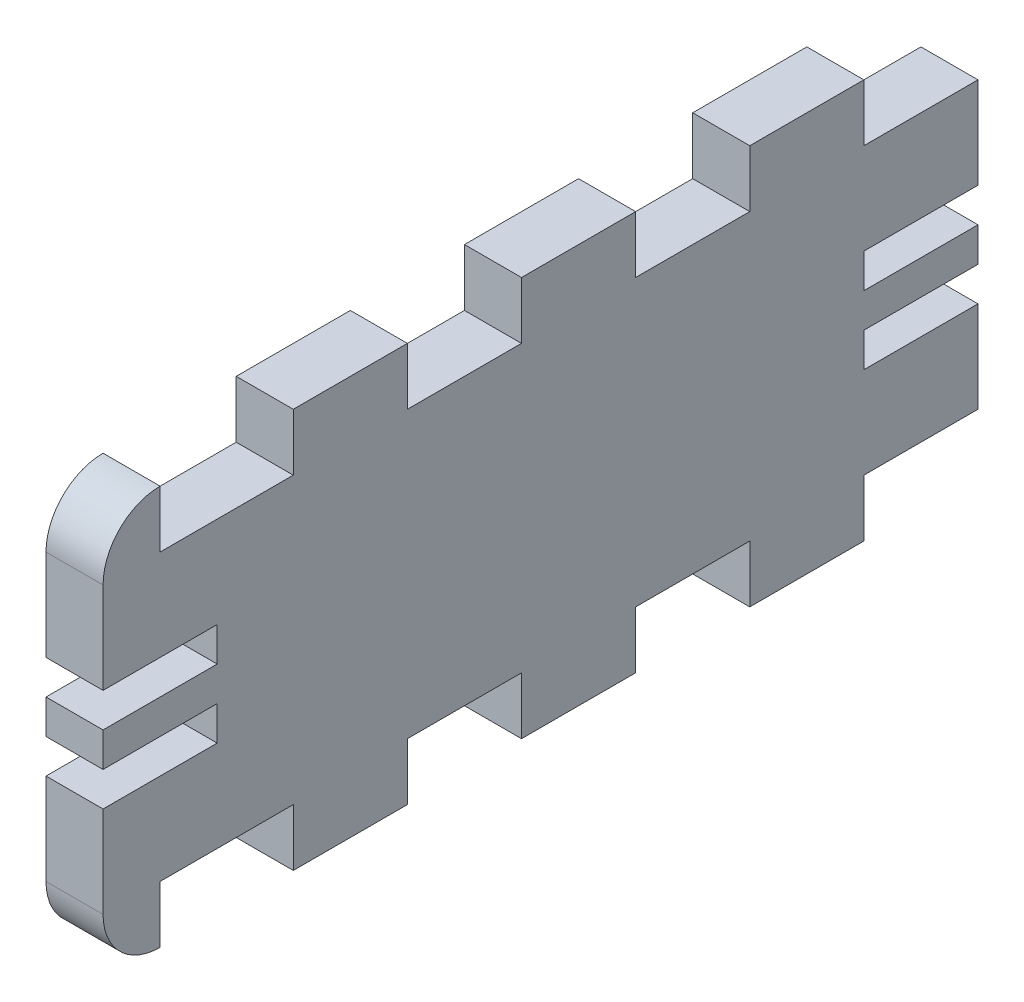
ISO-10303-21;
HEADER;
FILE_DESCRIPTION(('STEP AP214'),'2;1');
FILE_NAME('part.step','',(''),(''),'','','');
FILE_SCHEMA(('AUTOMOTIVE_DESIGN { 1 0 10303 214 1 1 1 1 }'));
ENDSEC;
DATA;
#1=APPLICATION_CONTEXT('core data for automotive mechanical design processes');
#2=APPLICATION_PROTOCOL_DEFINITION('international standard','automotive_design',2000,#1);
#3=PRODUCT_CONTEXT('',#1,'mechanical');
#4=PRODUCT('Part','Part','',(#3));
#5=PRODUCT_RELATED_PRODUCT_CATEGORY('part','',(#4));
#6=PRODUCT_DEFINITION_FORMATION('','',#4);
#7=PRODUCT_DEFINITION_CONTEXT('part definition',#1,'design');
#8=PRODUCT_DEFINITION('design','',#6,#7);
#9=PRODUCT_DEFINITION_SHAPE('','',#8);
#10=(LENGTH_UNIT() NAMED_UNIT(*) SI_UNIT(.MILLI.,.METRE.));
#11=(NAMED_UNIT(*) PLANE_ANGLE_UNIT() SI_UNIT($,.RADIAN.));
#12=(NAMED_UNIT(*) SI_UNIT($,.STERADIAN.) SOLID_ANGLE_UNIT());
#13=UNCERTAINTY_MEASURE_WITH_UNIT(LENGTH_MEASURE(1.E-05),#10,'distance_accuracy_value','');
#14=(GEOMETRIC_REPRESENTATION_CONTEXT(3) GLOBAL_UNCERTAINTY_ASSIGNED_CONTEXT((#13)) GLOBAL_UNIT_ASSIGNED_CONTEXT((#10,
#11,#12)) REPRESENTATION_CONTEXT('',''));
#15=CARTESIAN_POINT('',(0.,0.,0.));
#16=DIRECTION('',(0.,0.,1.));
#17=DIRECTION('',(1.,0.,0.));
#18=AXIS2_PLACEMENT_3D('',#15,#16,#17);
#19=CARTESIAN_POINT('',(3.,-10.5,23.));
#20=DIRECTION('',(0.,1.,0.));
#21=DIRECTION('',(0.,0.,1.));
#22=AXIS2_PLACEMENT_3D('',#19,#20,#21);
#23=PLANE('',#22);
#24=DIRECTION('',(0.,0.,-1.));
#25=VECTOR('',#24,1.);
#26=CARTESIAN_POINT('',(3.,-10.5,23.));
#27=LINE('',#26,#25);
#28=CARTESIAN_POINT('',(3.,-10.5,1.));
#29=VERTEX_POINT('',#28);
#30=CARTESIAN_POINT('',(3.,-10.5,-5.));
#31=VERTEX_POINT('',#30);
#32=EDGE_CURVE('E599',#29,#31,#27,.T.);
#33=ORIENTED_EDGE('',*,*,#32,.F.);
#34=DIRECTION('',(1.,0.,0.));
#35=VECTOR('',#34,1.);
#36=CARTESIAN_POINT('',(-7.,-10.5,1.));
#37=LINE('',#36,#35);
#38=CARTESIAN_POINT('',(0.,-10.5,1.));
#39=VERTEX_POINT('',#38);
#40=EDGE_CURVE('E374',#39,#29,#37,.T.);
#41=ORIENTED_EDGE('',*,*,#40,.F.);
#42=DIRECTION('',(0.,0.,-1.));
#43=VECTOR('',#42,1.);
#44=CARTESIAN_POINT('',(0.,-10.5,23.));
#45=LINE('',#44,#43);
#46=CARTESIAN_POINT('',(0.,-10.5,-5.));
#47=VERTEX_POINT('',#46);
#48=EDGE_CURVE('E615',#39,#47,#45,.T.);
#49=ORIENTED_EDGE('',*,*,#48,.T.);
#50=DIRECTION('',(1.,0.,0.));
#51=VECTOR('',#50,1.);
#52=CARTESIAN_POINT('',(-7.,-10.5,-5.));
#53=LINE('',#52,#51);
#54=EDGE_CURVE('E393',#47,#31,#53,.T.);
#55=ORIENTED_EDGE('',*,*,#54,.T.);
#56=EDGE_LOOP('',(#33,#41,#49,#55));
#57=FACE_BOUND('',#56,.T.);
#58=ADVANCED_FACE('F31',(#57),#23,.F.);
#59=CARTESIAN_POINT('',(3.,-10.5,-11.));
#60=VERTEX_POINT('',#59);
#61=CARTESIAN_POINT('',(3.,-10.5,-17.));
#62=VERTEX_POINT('',#61);
#63=EDGE_CURVE('E594',#60,#62,#27,.T.);
#64=ORIENTED_EDGE('',*,*,#63,.F.);
#65=DIRECTION('',(1.,0.,0.));
#66=VECTOR('',#65,1.);
#67=CARTESIAN_POINT('',(-7.,-10.5,-11.));
#68=LINE('',#67,#66);
#69=CARTESIAN_POINT('',(0.,-10.5,-11.));
#70=VERTEX_POINT('',#69);
#71=EDGE_CURVE('E390',#70,#60,#68,.T.);
#72=ORIENTED_EDGE('',*,*,#71,.F.);
#73=CARTESIAN_POINT('',(0.,-10.5,-17.));
#74=VERTEX_POINT('',#73);
#75=EDGE_CURVE('E611',#70,#74,#45,.T.);
#76=ORIENTED_EDGE('',*,*,#75,.T.);
#77=DIRECTION('',(1.,0.,0.));
#78=VECTOR('',#77,1.);
#79=CARTESIAN_POINT('',(-7.,-10.5,-17.));
#80=LINE('',#79,#78);
#81=EDGE_CURVE('E403',#74,#62,#80,.T.);
#82=ORIENTED_EDGE('',*,*,#81,.T.);
#83=EDGE_LOOP('',(#64,#72,#76,#82));
#84=FACE_BOUND('',#83,.T.);
#85=ADVANCED_FACE('F693',(#84),#23,.F.);
#86=CARTESIAN_POINT('',(3.,10.5,23.));
#87=DIRECTION('',(0.,-1.,0.));
#88=DIRECTION('',(0.,0.,-1.));
#89=AXIS2_PLACEMENT_3D('',#86,#87,#88);
#90=PLANE('',#89);
#91=DIRECTION('',(0.,0.,1.));
#92=VECTOR('',#91,1.);
#93=CARTESIAN_POINT('',(3.,10.5,23.));
#94=LINE('',#93,#92);
#95=CARTESIAN_POINT('',(3.,10.5,-5.));
#96=VERTEX_POINT('',#95);
#97=CARTESIAN_POINT('',(3.,10.5,1.));
#98=VERTEX_POINT('',#97);
#99=EDGE_CURVE('E590',#96,#98,#94,.T.);
#100=ORIENTED_EDGE('',*,*,#99,.F.);
#101=DIRECTION('',(1.,0.,0.));
#102=VECTOR('',#101,1.);
#103=CARTESIAN_POINT('',(-7.,10.5,-5.));
#104=LINE('',#103,#102);
#105=CARTESIAN_POINT('',(0.,10.5,-5.));
#106=VERTEX_POINT('',#105);
#107=EDGE_CURVE('E432',#106,#96,#104,.T.);
#108=ORIENTED_EDGE('',*,*,#107,.F.);
#109=DIRECTION('',(0.,0.,1.));
#110=VECTOR('',#109,1.);
#111=CARTESIAN_POINT('',(0.,10.5,23.));
#112=LINE('',#111,#110);
#113=CARTESIAN_POINT('',(0.,10.5,1.));
#114=VERTEX_POINT('',#113);
#115=EDGE_CURVE('E607',#106,#114,#112,.T.);
#116=ORIENTED_EDGE('',*,*,#115,.T.);
#117=DIRECTION('',(1.,0.,0.));
#118=VECTOR('',#117,1.);
#119=CARTESIAN_POINT('',(-7.,10.5,1.));
#120=LINE('',#119,#118);
#121=EDGE_CURVE('E453',#114,#98,#120,.T.);
#122=ORIENTED_EDGE('',*,*,#121,.T.);
#123=EDGE_LOOP('',(#100,#108,#116,#122));
#124=FACE_BOUND('',#123,.T.);
#125=ADVANCED_FACE('F763',(#124),#90,.F.);
#126=CARTESIAN_POINT('',(3.,10.5,7.));
#127=VERTEX_POINT('',#126);
#128=CARTESIAN_POINT('',(3.,10.5,13.));
#129=VERTEX_POINT('',#128);
#130=EDGE_CURVE('E584',#127,#129,#94,.T.);
#131=ORIENTED_EDGE('',*,*,#130,.F.);
#132=DIRECTION('',(1.,0.,0.));
#133=VECTOR('',#132,1.);
#134=CARTESIAN_POINT('',(-7.,10.5,7.));
#135=LINE('',#134,#133);
#136=CARTESIAN_POINT('',(0.,10.5,7.));
#137=VERTEX_POINT('',#136);
#138=EDGE_CURVE('E450',#137,#127,#135,.T.);
#139=ORIENTED_EDGE('',*,*,#138,.F.);
#140=CARTESIAN_POINT('',(0.,10.5,13.));
#141=VERTEX_POINT('',#140);
#142=EDGE_CURVE('E602',#137,#141,#112,.T.);
#143=ORIENTED_EDGE('',*,*,#142,.T.);
#144=DIRECTION('',(1.,0.,0.));
#145=VECTOR('',#144,1.);
#146=CARTESIAN_POINT('',(-7.,10.5,13.));
#147=LINE('',#146,#145);
#148=EDGE_CURVE('E468',#141,#129,#147,.T.);
#149=ORIENTED_EDGE('',*,*,#148,.T.);
#150=EDGE_LOOP('',(#131,#139,#143,#149));
#151=FACE_BOUND('',#150,.T.);
#152=ADVANCED_FACE('F778',(#151),#90,.F.);
#153=CARTESIAN_POINT('',(3.,-10.5,-23.));
#154=DIRECTION('',(0.,0.,1.));
#155=DIRECTION('',(1.,0.,0.));
#156=AXIS2_PLACEMENT_3D('',#153,#154,#155);
#157=PLANE('',#156);
#158=DIRECTION('',(0.,1.,0.));
#159=VECTOR('',#158,1.);
#160=CARTESIAN_POINT('',(0.,-10.5,-23.));
#161=LINE('',#160,#159);
#162=CARTESIAN_POINT('',(0.,-0.899999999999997,-23.));
#163=VERTEX_POINT('',#162);
#164=CARTESIAN_POINT('',(0.,0.900000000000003,-23.));
#165=VERTEX_POINT('',#164);
#166=EDGE_CURVE('E603',#163,#165,#161,.T.);
#167=ORIENTED_EDGE('',*,*,#166,.T.);
#168=DIRECTION('',(-1.,0.,0.));
#169=VECTOR('',#168,1.);
#170=CARTESIAN_POINT('',(10.,0.900000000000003,-23.));
#171=LINE('',#170,#169);
#172=CARTESIAN_POINT('',(3.,0.900000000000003,-23.));
#173=VERTEX_POINT('',#172);
#174=EDGE_CURVE('E487',#173,#165,#171,.T.);
#175=ORIENTED_EDGE('',*,*,#174,.F.);
#176=DIRECTION('',(0.,1.,0.));
#177=VECTOR('',#176,1.);
#178=CARTESIAN_POINT('',(3.,-10.5,-23.));
#179=LINE('',#178,#177);
#180=CARTESIAN_POINT('',(3.,-0.899999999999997,-23.));
#181=VERTEX_POINT('',#180);
#182=EDGE_CURVE('E585',#181,#173,#179,.T.);
#183=ORIENTED_EDGE('',*,*,#182,.F.);
#184=DIRECTION('',(-1.,0.,0.));
#185=VECTOR('',#184,1.);
#186=CARTESIAN_POINT('',(10.,-0.899999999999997,-23.));
#187=LINE('',#186,#185);
#188=EDGE_CURVE('E516',#181,#163,#187,.T.);
#189=ORIENTED_EDGE('',*,*,#188,.T.);
#190=EDGE_LOOP('',(#167,#175,#183,#189));
#191=FACE_BOUND('',#190,.T.);
#192=ADVANCED_FACE('F724',(#191),#157,.F.);
#193=CARTESIAN_POINT('',(3.,-7.5,-23.));
#194=VERTEX_POINT('',#193);
#195=CARTESIAN_POINT('',(3.,-2.7,-23.));
#196=VERTEX_POINT('',#195);
#197=EDGE_CURVE('E582',#194,#196,#179,.T.);
#198=ORIENTED_EDGE('',*,*,#197,.F.);
#199=DIRECTION('',(1.,0.,0.));
#200=VECTOR('',#199,1.);
#201=CARTESIAN_POINT('',(-7.,-7.5,-23.));
#202=LINE('',#201,#200);
#203=CARTESIAN_POINT('',(0.,-7.5,-23.));
#204=VERTEX_POINT('',#203);
#205=EDGE_CURVE('E407',#204,#194,#202,.T.);
#206=ORIENTED_EDGE('',*,*,#205,.F.);
#207=CARTESIAN_POINT('',(0.,-2.7,-23.));
#208=VERTEX_POINT('',#207);
#209=EDGE_CURVE('E600',#204,#208,#161,.T.);
#210=ORIENTED_EDGE('',*,*,#209,.T.);
#211=DIRECTION('',(-1.,0.,0.));
#212=VECTOR('',#211,1.);
#213=CARTESIAN_POINT('',(10.,-2.7,-23.));
#214=LINE('',#213,#212);
#215=EDGE_CURVE('E513',#196,#208,#214,.T.);
#216=ORIENTED_EDGE('',*,*,#215,.F.);
#217=EDGE_LOOP('',(#198,#206,#210,#216));
#218=FACE_BOUND('',#217,.T.);
#219=ADVANCED_FACE('F708',(#218),#157,.F.);
#220=CARTESIAN_POINT('',(3.,-10.5,23.));
#221=DIRECTION('',(0.,0.,-1.));
#222=DIRECTION('',(-1.,0.,0.));
#223=AXIS2_PLACEMENT_3D('',#220,#221,#222);
#224=PLANE('',#223);
#225=DIRECTION('',(0.,-1.,0.));
#226=VECTOR('',#225,1.);
#227=CARTESIAN_POINT('',(0.,-10.5,23.));
#228=LINE('',#227,#226);
#229=CARTESIAN_POINT('',(0.,0.900000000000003,23.));
#230=VERTEX_POINT('',#229);
#231=CARTESIAN_POINT('',(0.,-0.899999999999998,23.));
#232=VERTEX_POINT('',#231);
#233=EDGE_CURVE('E612',#230,#232,#228,.T.);
#234=ORIENTED_EDGE('',*,*,#233,.T.);
#235=DIRECTION('',(-1.,0.,0.));
#236=VECTOR('',#235,1.);
#237=CARTESIAN_POINT('',(10.,-0.899999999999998,23.));
#238=LINE('',#237,#236);
#239=CARTESIAN_POINT('',(3.,-0.899999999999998,23.));
#240=VERTEX_POINT('',#239);
#241=EDGE_CURVE('E540',#240,#232,#238,.T.);
#242=ORIENTED_EDGE('',*,*,#241,.F.);
#243=DIRECTION('',(0.,-1.,0.));
#244=VECTOR('',#243,1.);
#245=CARTESIAN_POINT('',(3.,-10.5,23.));
#246=LINE('',#245,#244);
#247=CARTESIAN_POINT('',(3.,0.900000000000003,23.));
#248=VERTEX_POINT('',#247);
#249=EDGE_CURVE('E595',#248,#240,#246,.T.);
#250=ORIENTED_EDGE('',*,*,#249,.F.);
#251=DIRECTION('',(-1.,0.,0.));
#252=VECTOR('',#251,1.);
#253=CARTESIAN_POINT('',(10.,0.900000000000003,23.));
#254=LINE('',#253,#252);
#255=EDGE_CURVE('E568',#248,#230,#254,.T.);
#256=ORIENTED_EDGE('',*,*,#255,.T.);
#257=EDGE_LOOP('',(#234,#242,#250,#256));
#258=FACE_BOUND('',#257,.T.);
#259=ADVANCED_FACE('F820',(#258),#224,.F.);
#260=CARTESIAN_POINT('',(0.,7.5,23.));
#261=VERTEX_POINT('',#260);
#262=CARTESIAN_POINT('',(0.,2.7,23.));
#263=VERTEX_POINT('',#262);
#264=EDGE_CURVE('E608',#261,#263,#228,.T.);
#265=ORIENTED_EDGE('',*,*,#264,.T.);
#266=DIRECTION('',(-1.,0.,0.));
#267=VECTOR('',#266,1.);
#268=CARTESIAN_POINT('',(10.,2.7,23.));
#269=LINE('',#268,#267);
#270=CARTESIAN_POINT('',(3.,2.7,23.));
#271=VERTEX_POINT('',#270);
#272=EDGE_CURVE('E566',#271,#263,#269,.T.);
#273=ORIENTED_EDGE('',*,*,#272,.F.);
#274=CARTESIAN_POINT('',(3.,7.5,23.));
#275=VERTEX_POINT('',#274);
#276=EDGE_CURVE('E591',#275,#271,#246,.T.);
#277=ORIENTED_EDGE('',*,*,#276,.F.);
#278=DIRECTION('',(-1.,0.,0.));
#279=VECTOR('',#278,1.);
#280=CARTESIAN_POINT('',(3.,7.5,23.));
#281=LINE('',#280,#279);
#282=EDGE_CURVE('E623',#275,#261,#281,.T.);
#283=ORIENTED_EDGE('',*,*,#282,.T.);
#284=EDGE_LOOP('',(#265,#273,#277,#283));
#285=FACE_BOUND('',#284,.T.);
#286=ADVANCED_FACE('F821',(#285),#224,.F.);
#287=CARTESIAN_POINT('',(0.,2.7,-23.));
#288=VERTEX_POINT('',#287);
#289=CARTESIAN_POINT('',(0.,7.5,-23.));
#290=VERTEX_POINT('',#289);
#291=EDGE_CURVE('E581',#288,#290,#161,.T.);
#292=ORIENTED_EDGE('',*,*,#291,.T.);
#293=DIRECTION('',(1.,0.,0.));
#294=VECTOR('',#293,1.);
#295=CARTESIAN_POINT('',(-7.,7.5,-23.));
#296=LINE('',#295,#294);
#297=CARTESIAN_POINT('',(3.,7.5,-23.));
#298=VERTEX_POINT('',#297);
#299=EDGE_CURVE('E419',#290,#298,#296,.T.);
#300=ORIENTED_EDGE('',*,*,#299,.T.);
#301=CARTESIAN_POINT('',(3.,2.7,-23.));
#302=VERTEX_POINT('',#301);
#303=EDGE_CURVE('E586',#302,#298,#179,.T.);
#304=ORIENTED_EDGE('',*,*,#303,.F.);
#305=DIRECTION('',(-1.,0.,0.));
#306=VECTOR('',#305,1.);
#307=CARTESIAN_POINT('',(10.,2.7,-23.));
#308=LINE('',#307,#306);
#309=EDGE_CURVE('E489',#302,#288,#308,.T.);
#310=ORIENTED_EDGE('',*,*,#309,.T.);
#311=EDGE_LOOP('',(#292,#300,#304,#310));
#312=FACE_BOUND('',#311,.T.);
#313=ADVANCED_FACE('F732',(#312),#157,.F.);
#314=CARTESIAN_POINT('',(3.,10.5,-17.));
#315=VERTEX_POINT('',#314);
#316=CARTESIAN_POINT('',(3.,10.5,-11.));
#317=VERTEX_POINT('',#316);
#318=EDGE_CURVE('E587',#315,#317,#94,.T.);
#319=ORIENTED_EDGE('',*,*,#318,.F.);
#320=DIRECTION('',(1.,0.,0.));
#321=VECTOR('',#320,1.);
#322=CARTESIAN_POINT('',(-7.,10.5,-17.));
#323=LINE('',#322,#321);
#324=CARTESIAN_POINT('',(0.,10.5,-17.));
#325=VERTEX_POINT('',#324);
#326=EDGE_CURVE('E416',#325,#315,#323,.T.);
#327=ORIENTED_EDGE('',*,*,#326,.F.);
#328=CARTESIAN_POINT('',(0.,10.5,-11.));
#329=VERTEX_POINT('',#328);
#330=EDGE_CURVE('E604',#325,#329,#112,.T.);
#331=ORIENTED_EDGE('',*,*,#330,.T.);
#332=DIRECTION('',(1.,0.,0.));
#333=VECTOR('',#332,1.);
#334=CARTESIAN_POINT('',(-7.,10.5,-11.));
#335=LINE('',#334,#333);
#336=EDGE_CURVE('E435',#329,#317,#335,.T.);
#337=ORIENTED_EDGE('',*,*,#336,.T.);
#338=EDGE_LOOP('',(#319,#327,#331,#337));
#339=FACE_BOUND('',#338,.T.);
#340=ADVANCED_FACE('F747',(#339),#90,.F.);
#341=CARTESIAN_POINT('',(3.,-2.7,23.));
#342=VERTEX_POINT('',#341);
#343=CARTESIAN_POINT('',(3.,-7.5,23.));
#344=VERTEX_POINT('',#343);
#345=EDGE_CURVE('E589',#342,#344,#246,.T.);
#346=ORIENTED_EDGE('',*,*,#345,.F.);
#347=DIRECTION('',(-1.,0.,0.));
#348=VECTOR('',#347,1.);
#349=CARTESIAN_POINT('',(10.,-2.7,23.));
#350=LINE('',#349,#348);
#351=CARTESIAN_POINT('',(0.,-2.7,23.));
#352=VERTEX_POINT('',#351);
#353=EDGE_CURVE('E542',#342,#352,#350,.T.);
#354=ORIENTED_EDGE('',*,*,#353,.T.);
#355=CARTESIAN_POINT('',(0.,-7.5,23.));
#356=VERTEX_POINT('',#355);
#357=EDGE_CURVE('E606',#352,#356,#228,.T.);
#358=ORIENTED_EDGE('',*,*,#357,.T.);
#359=DIRECTION('',(-1.,0.,0.));
#360=VECTOR('',#359,1.);
#361=CARTESIAN_POINT('',(3.,-7.5,23.));
#362=LINE('',#361,#360);
#363=EDGE_CURVE('E626',#356,#344,#362,.F.);
#364=ORIENTED_EDGE('',*,*,#363,.T.);
#365=EDGE_LOOP('',(#346,#354,#358,#364));
#366=FACE_BOUND('',#365,.T.);
#367=ADVANCED_FACE('F812',(#366),#224,.F.);
#368=CARTESIAN_POINT('',(3.,-10.5,13.));
#369=VERTEX_POINT('',#368);
#370=CARTESIAN_POINT('',(3.,-10.5,7.));
#371=VERTEX_POINT('',#370);
#372=EDGE_CURVE('E596',#369,#371,#27,.T.);
#373=ORIENTED_EDGE('',*,*,#372,.F.);
#374=DIRECTION('',(1.,0.,0.));
#375=VECTOR('',#374,1.);
#376=CARTESIAN_POINT('',(-7.,-10.5,13.));
#377=LINE('',#376,#375);
#378=CARTESIAN_POINT('',(0.,-10.5,13.));
#379=VERTEX_POINT('',#378);
#380=EDGE_CURVE('E352',#379,#369,#377,.T.);
#381=ORIENTED_EDGE('',*,*,#380,.F.);
#382=CARTESIAN_POINT('',(0.,-10.5,7.));
#383=VERTEX_POINT('',#382);
#384=EDGE_CURVE('E613',#379,#383,#45,.T.);
#385=ORIENTED_EDGE('',*,*,#384,.T.);
#386=DIRECTION('',(1.,0.,0.));
#387=VECTOR('',#386,1.);
#388=CARTESIAN_POINT('',(-7.,-10.5,7.));
#389=LINE('',#388,#387);
#390=EDGE_CURVE('E377',#383,#371,#389,.T.);
#391=ORIENTED_EDGE('',*,*,#390,.T.);
#392=EDGE_LOOP('',(#373,#381,#385,#391));
#393=FACE_BOUND('',#392,.T.);
#394=ADVANCED_FACE('F805',(#393),#23,.F.);
#395=CARTESIAN_POINT('',(3.,10.5,-23.));
#396=DIRECTION('',(-1.,0.,0.));
#397=DIRECTION('',(0.,0.,1.));
#398=AXIS2_PLACEMENT_3D('',#395,#396,#397);
#399=PLANE('',#398);
#400=DIRECTION('',(0.,0.,1.));
#401=VECTOR('',#400,1.);
#402=CARTESIAN_POINT('',(3.,-7.5,13.));
#403=LINE('',#402,#401);
#404=CARTESIAN_POINT('',(3.,-7.5,13.));
#405=VERTEX_POINT('',#404);
#406=CARTESIAN_POINT('',(3.,-7.5,20.));
#407=VERTEX_POINT('',#406);
#408=EDGE_CURVE('E340',#405,#407,#403,.T.);
#409=ORIENTED_EDGE('',*,*,#408,.F.);
#410=DIRECTION('',(0.,1.,0.));
#411=VECTOR('',#410,1.);
#412=CARTESIAN_POINT('',(3.,-7.5,13.));
#413=LINE('',#412,#411);
#414=EDGE_CURVE('E349',#369,#405,#413,.T.);
#415=ORIENTED_EDGE('',*,*,#414,.F.);
#416=ORIENTED_EDGE('',*,*,#372,.T.);
#417=DIRECTION('',(0.,-1.,0.));
#418=VECTOR('',#417,1.);
#419=CARTESIAN_POINT('',(3.,-7.5,7.));
#420=LINE('',#419,#418);
#421=CARTESIAN_POINT('',(3.,-7.5,7.));
#422=VERTEX_POINT('',#421);
#423=EDGE_CURVE('E370',#422,#371,#420,.T.);
#424=ORIENTED_EDGE('',*,*,#423,.F.);
#425=DIRECTION('',(0.,0.,1.));
#426=VECTOR('',#425,1.);
#427=CARTESIAN_POINT('',(3.,-7.5,1.));
#428=LINE('',#427,#426);
#429=CARTESIAN_POINT('',(3.,-7.5,1.));
#430=VERTEX_POINT('',#429);
#431=EDGE_CURVE('E368',#430,#422,#428,.T.);
#432=ORIENTED_EDGE('',*,*,#431,.F.);
#433=DIRECTION('',(0.,1.,0.));
#434=VECTOR('',#433,1.);
#435=CARTESIAN_POINT('',(3.,-7.5,1.));
#436=LINE('',#435,#434);
#437=EDGE_CURVE('E365',#29,#430,#436,.T.);
#438=ORIENTED_EDGE('',*,*,#437,.F.);
#439=ORIENTED_EDGE('',*,*,#32,.T.);
#440=DIRECTION('',(0.,-1.,0.));
#441=VECTOR('',#440,1.);
#442=CARTESIAN_POINT('',(3.,-7.5,-5.));
#443=LINE('',#442,#441);
#444=CARTESIAN_POINT('',(3.,-7.5,-5.));
#445=VERTEX_POINT('',#444);
#446=EDGE_CURVE('E386',#445,#31,#443,.T.);
#447=ORIENTED_EDGE('',*,*,#446,.F.);
#448=DIRECTION('',(0.,0.,1.));
#449=VECTOR('',#448,1.);
#450=CARTESIAN_POINT('',(3.,-7.5,-11.));
#451=LINE('',#450,#449);
#452=CARTESIAN_POINT('',(3.,-7.5,-11.));
#453=VERTEX_POINT('',#452);
#454=EDGE_CURVE('E384',#453,#445,#451,.T.);
#455=ORIENTED_EDGE('',*,*,#454,.F.);
#456=DIRECTION('',(0.,1.,0.));
#457=VECTOR('',#456,1.);
#458=CARTESIAN_POINT('',(3.,-7.5,-11.));
#459=LINE('',#458,#457);
#460=EDGE_CURVE('E376',#60,#453,#459,.T.);
#461=ORIENTED_EDGE('',*,*,#460,.F.);
#462=ORIENTED_EDGE('',*,*,#63,.T.);
#463=DIRECTION('',(0.,-1.,0.));
#464=VECTOR('',#463,1.);
#465=CARTESIAN_POINT('',(3.,-7.5,-17.));
#466=LINE('',#465,#464);
#467=CARTESIAN_POINT('',(3.,-7.5,-17.));
#468=VERTEX_POINT('',#467);
#469=EDGE_CURVE('E392',#468,#62,#466,.T.);
#470=ORIENTED_EDGE('',*,*,#469,.F.);
#471=DIRECTION('',(0.,0.,1.));
#472=VECTOR('',#471,1.);
#473=CARTESIAN_POINT('',(3.,-7.5,-17.));
#474=LINE('',#473,#472);
#475=EDGE_CURVE('E400',#194,#468,#474,.T.);
#476=ORIENTED_EDGE('',*,*,#475,.F.);
#477=ORIENTED_EDGE('',*,*,#197,.T.);
#478=DIRECTION('',(0.,0.,1.));
#479=VECTOR('',#478,1.);
#480=CARTESIAN_POINT('',(3.,-2.7,-23.));
#481=LINE('',#480,#479);
#482=CARTESIAN_POINT('',(3.,-2.7,-17.));
#483=VERTEX_POINT('',#482);
#484=EDGE_CURVE('E523',#196,#483,#481,.T.);
#485=ORIENTED_EDGE('',*,*,#484,.T.);
#486=DIRECTION('',(0.,1.,0.));
#487=VECTOR('',#486,1.);
#488=CARTESIAN_POINT('',(3.,10.5,-17.));
#489=LINE('',#488,#487);
#490=CARTESIAN_POINT('',(3.,-0.899999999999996,-17.));
#491=VERTEX_POINT('',#490);
#492=EDGE_CURVE('E526',#483,#491,#489,.T.);
#493=ORIENTED_EDGE('',*,*,#492,.T.);
#494=DIRECTION('',(0.,0.,-1.));
#495=VECTOR('',#494,1.);
#496=CARTESIAN_POINT('',(3.,-0.899999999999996,-23.));
#497=LINE('',#496,#495);
#498=EDGE_CURVE('E512',#491,#181,#497,.T.);
#499=ORIENTED_EDGE('',*,*,#498,.T.);
#500=ORIENTED_EDGE('',*,*,#182,.T.);
#501=DIRECTION('',(0.,0.,1.));
#502=VECTOR('',#501,1.);
#503=CARTESIAN_POINT('',(3.,0.900000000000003,-23.));
#504=LINE('',#503,#502);
#505=CARTESIAN_POINT('',(3.,0.900000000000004,-17.));
#506=VERTEX_POINT('',#505);
#507=EDGE_CURVE('E496',#173,#506,#504,.T.);
#508=ORIENTED_EDGE('',*,*,#507,.T.);
#509=DIRECTION('',(0.,1.,0.));
#510=VECTOR('',#509,1.);
#511=CARTESIAN_POINT('',(3.,10.5,-17.));
#512=LINE('',#511,#510);
#513=CARTESIAN_POINT('',(3.,2.7,-17.));
#514=VERTEX_POINT('',#513);
#515=EDGE_CURVE('E499',#506,#514,#512,.T.);
#516=ORIENTED_EDGE('',*,*,#515,.T.);
#517=DIRECTION('',(0.,0.,-1.));
#518=VECTOR('',#517,1.);
#519=CARTESIAN_POINT('',(3.,2.7,-23.));
#520=LINE('',#519,#518);
#521=EDGE_CURVE('E486',#514,#302,#520,.T.);
#522=ORIENTED_EDGE('',*,*,#521,.T.);
#523=ORIENTED_EDGE('',*,*,#303,.T.);
#524=DIRECTION('',(0.,0.,-1.));
#525=VECTOR('',#524,1.);
#526=CARTESIAN_POINT('',(3.,7.5,-17.));
#527=LINE('',#526,#525);
#528=CARTESIAN_POINT('',(3.,7.5,-17.));
#529=VERTEX_POINT('',#528);
#530=EDGE_CURVE('E413',#529,#298,#527,.T.);
#531=ORIENTED_EDGE('',*,*,#530,.F.);
#532=DIRECTION('',(0.,-1.,0.));
#533=VECTOR('',#532,1.);
#534=CARTESIAN_POINT('',(3.,7.5,-17.));
#535=LINE('',#534,#533);
#536=EDGE_CURVE('E406',#315,#529,#535,.T.);
#537=ORIENTED_EDGE('',*,*,#536,.F.);
#538=ORIENTED_EDGE('',*,*,#318,.T.);
#539=DIRECTION('',(0.,1.,0.));
#540=VECTOR('',#539,1.);
#541=CARTESIAN_POINT('',(3.,7.5,-11.));
#542=LINE('',#541,#540);
#543=CARTESIAN_POINT('',(3.,7.5,-11.));
#544=VERTEX_POINT('',#543);
#545=EDGE_CURVE('E428',#544,#317,#542,.T.);
#546=ORIENTED_EDGE('',*,*,#545,.F.);
#547=DIRECTION('',(0.,0.,-1.));
#548=VECTOR('',#547,1.);
#549=CARTESIAN_POINT('',(3.,7.5,-5.));
#550=LINE('',#549,#548);
#551=CARTESIAN_POINT('',(3.,7.5,-5.));
#552=VERTEX_POINT('',#551);
#553=EDGE_CURVE('E425',#552,#544,#550,.T.);
#554=ORIENTED_EDGE('',*,*,#553,.F.);
#555=DIRECTION('',(0.,-1.,0.));
#556=VECTOR('',#555,1.);
#557=CARTESIAN_POINT('',(3.,7.5,-5.));
#558=LINE('',#557,#556);
#559=EDGE_CURVE('E418',#96,#552,#558,.T.);
#560=ORIENTED_EDGE('',*,*,#559,.F.);
#561=ORIENTED_EDGE('',*,*,#99,.T.);
#562=DIRECTION('',(0.,1.,0.));
#563=VECTOR('',#562,1.);
#564=CARTESIAN_POINT('',(3.,7.5,1.));
#565=LINE('',#564,#563);
#566=CARTESIAN_POINT('',(3.,7.5,1.));
#567=VERTEX_POINT('',#566);
#568=EDGE_CURVE('E446',#567,#98,#565,.T.);
#569=ORIENTED_EDGE('',*,*,#568,.F.);
#570=DIRECTION('',(0.,0.,-1.));
#571=VECTOR('',#570,1.);
#572=CARTESIAN_POINT('',(3.,7.5,7.));
#573=LINE('',#572,#571);
#574=CARTESIAN_POINT('',(3.,7.5,7.));
#575=VERTEX_POINT('',#574);
#576=EDGE_CURVE('E443',#575,#567,#573,.T.);
#577=ORIENTED_EDGE('',*,*,#576,.F.);
#578=DIRECTION('',(0.,-1.,0.));
#579=VECTOR('',#578,1.);
#580=CARTESIAN_POINT('',(3.,7.5,7.));
#581=LINE('',#580,#579);
#582=EDGE_CURVE('E434',#127,#575,#581,.T.);
#583=ORIENTED_EDGE('',*,*,#582,.F.);
#584=ORIENTED_EDGE('',*,*,#130,.T.);
#585=DIRECTION('',(0.,1.,0.));
#586=VECTOR('',#585,1.);
#587=CARTESIAN_POINT('',(3.,7.5,13.));
#588=LINE('',#587,#586);
#589=CARTESIAN_POINT('',(3.,7.5,13.));
#590=VERTEX_POINT('',#589);
#591=EDGE_CURVE('E464',#590,#129,#588,.T.);
#592=ORIENTED_EDGE('',*,*,#591,.F.);
#593=DIRECTION('',(0.,0.,-1.));
#594=VECTOR('',#593,1.);
#595=CARTESIAN_POINT('',(3.,7.5,20.));
#596=LINE('',#595,#594);
#597=CARTESIAN_POINT('',(3.,7.5,20.));
#598=VERTEX_POINT('',#597);
#599=EDGE_CURVE('E461',#598,#590,#596,.T.);
#600=ORIENTED_EDGE('',*,*,#599,.F.);
#601=DIRECTION('',(0.,-1.,0.));
#602=VECTOR('',#601,1.);
#603=CARTESIAN_POINT('',(3.,7.5,20.));
#604=LINE('',#603,#602);
#605=CARTESIAN_POINT('',(3.,10.5,20.));
#606=VERTEX_POINT('',#605);
#607=EDGE_CURVE('E452',#606,#598,#604,.T.);
#608=ORIENTED_EDGE('',*,*,#607,.F.);
#609=CARTESIAN_POINT('',(3.,7.5,20.));
#610=DIRECTION('',(-1.,0.,0.));
#611=DIRECTION('',(0.,0.,1.));
#612=AXIS2_PLACEMENT_3D('',#609,#610,#611);
#613=CIRCLE('',#612,3.);
#614=EDGE_CURVE('E629',#606,#275,#613,.F.);
#615=ORIENTED_EDGE('',*,*,#614,.T.);
#616=ORIENTED_EDGE('',*,*,#276,.T.);
#617=DIRECTION('',(0.,0.,-1.));
#618=VECTOR('',#617,1.);
#619=CARTESIAN_POINT('',(3.,2.7,-23.));
#620=LINE('',#619,#618);
#621=CARTESIAN_POINT('',(3.,2.7,17.));
#622=VERTEX_POINT('',#621);
#623=EDGE_CURVE('E575',#271,#622,#620,.T.);
#624=ORIENTED_EDGE('',*,*,#623,.T.);
#625=DIRECTION('',(0.,-1.,0.));
#626=VECTOR('',#625,1.);
#627=CARTESIAN_POINT('',(3.,10.5,17.));
#628=LINE('',#627,#626);
#629=CARTESIAN_POINT('',(3.,0.900000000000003,17.));
#630=VERTEX_POINT('',#629);
#631=EDGE_CURVE('E578',#622,#630,#628,.T.);
#632=ORIENTED_EDGE('',*,*,#631,.T.);
#633=DIRECTION('',(0.,0.,1.));
#634=VECTOR('',#633,1.);
#635=CARTESIAN_POINT('',(3.,0.900000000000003,-23.));
#636=LINE('',#635,#634);
#637=EDGE_CURVE('E565',#630,#248,#636,.T.);
#638=ORIENTED_EDGE('',*,*,#637,.T.);
#639=ORIENTED_EDGE('',*,*,#249,.T.);
#640=DIRECTION('',(0.,0.,-1.));
#641=VECTOR('',#640,1.);
#642=CARTESIAN_POINT('',(3.,-0.899999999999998,-23.));
#643=LINE('',#642,#641);
#644=CARTESIAN_POINT('',(3.,-0.899999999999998,17.));
#645=VERTEX_POINT('',#644);
#646=EDGE_CURVE('E549',#240,#645,#643,.T.);
#647=ORIENTED_EDGE('',*,*,#646,.T.);
#648=DIRECTION('',(0.,-1.,0.));
#649=VECTOR('',#648,1.);
#650=CARTESIAN_POINT('',(3.,10.5,17.));
#651=LINE('',#650,#649);
#652=CARTESIAN_POINT('',(3.,-2.7,17.));
#653=VERTEX_POINT('',#652);
#654=EDGE_CURVE('E552',#645,#653,#651,.T.);
#655=ORIENTED_EDGE('',*,*,#654,.T.);
#656=DIRECTION('',(0.,0.,1.));
#657=VECTOR('',#656,1.);
#658=CARTESIAN_POINT('',(3.,-2.7,-23.));
#659=LINE('',#658,#657);
#660=EDGE_CURVE('E539',#653,#342,#659,.T.);
#661=ORIENTED_EDGE('',*,*,#660,.T.);
#662=ORIENTED_EDGE('',*,*,#345,.T.);
#663=CARTESIAN_POINT('',(3.,-7.5,20.));
#664=DIRECTION('',(-1.,0.,0.));
#665=DIRECTION('',(0.,0.,1.));
#666=AXIS2_PLACEMENT_3D('',#663,#664,#665);
#667=CIRCLE('',#666,3.);
#668=CARTESIAN_POINT('',(3.,-10.5,20.));
#669=VERTEX_POINT('',#668);
#670=EDGE_CURVE('E631',#344,#669,#667,.F.);
#671=ORIENTED_EDGE('',*,*,#670,.T.);
#672=DIRECTION('',(0.,-1.,0.));
#673=VECTOR('',#672,1.);
#674=CARTESIAN_POINT('',(3.,-7.5,20.));
#675=LINE('',#674,#673);
#676=EDGE_CURVE('E346',#407,#669,#675,.T.);
#677=ORIENTED_EDGE('',*,*,#676,.F.);
#678=EDGE_LOOP('',(#409,#415,#416,#424,#432,#438,#439,#447,#455,#461,#462,#470,#476,#477,#485,
#493,#499,#500,#508,#516,#522,#523,#531,#537,#538,#546,#554,#560,#561,#569,#577,#583,#584,#592,
#600,#608,#615,#616,#624,#632,#638,#639,#647,#655,#661,#662,#671,#677));
#679=FACE_BOUND('',#678,.T.);
#680=ADVANCED_FACE('F356',(#679),#399,.F.);
#681=CARTESIAN_POINT('',(0.,10.5,-23.));
#682=DIRECTION('',(-1.,0.,0.));
#683=DIRECTION('',(0.,0.,1.));
#684=AXIS2_PLACEMENT_3D('',#681,#682,#683);
#685=PLANE('',#684);
#686=DIRECTION('',(0.,-1.,0.));
#687=VECTOR('',#686,1.);
#688=CARTESIAN_POINT('',(0.,10.5,13.));
#689=LINE('',#688,#687);
#690=CARTESIAN_POINT('',(0.,-7.5,13.));
#691=VERTEX_POINT('',#690);
#692=EDGE_CURVE('E11',#691,#379,#689,.T.);
#693=ORIENTED_EDGE('',*,*,#692,.F.);
#694=DIRECTION('',(0.,0.,-1.));
#695=VECTOR('',#694,1.);
#696=CARTESIAN_POINT('',(0.,-7.5,-23.));
#697=LINE('',#696,#695);
#698=CARTESIAN_POINT('',(0.,-7.5,20.));
#699=VERTEX_POINT('',#698);
#700=EDGE_CURVE('E39',#699,#691,#697,.T.);
#701=ORIENTED_EDGE('',*,*,#700,.F.);
#702=DIRECTION('',(0.,1.,0.));
#703=VECTOR('',#702,1.);
#704=CARTESIAN_POINT('',(0.,10.5,20.));
#705=LINE('',#704,#703);
#706=CARTESIAN_POINT('',(0.,-10.5,20.));
#707=VERTEX_POINT('',#706);
#708=EDGE_CURVE('E362',#707,#699,#705,.T.);
#709=ORIENTED_EDGE('',*,*,#708,.F.);
#710=CARTESIAN_POINT('',(0.,-7.5,20.));
#711=DIRECTION('',(-1.,0.,0.));
#712=DIRECTION('',(0.,0.,1.));
#713=AXIS2_PLACEMENT_3D('',#710,#711,#712);
#714=CIRCLE('',#713,3.);
#715=EDGE_CURVE('E620',#707,#356,#714,.T.);
#716=ORIENTED_EDGE('',*,*,#715,.T.);
#717=ORIENTED_EDGE('',*,*,#357,.F.);
#718=DIRECTION('',(0.,0.,1.));
#719=VECTOR('',#718,1.);
#720=CARTESIAN_POINT('',(0.,-2.7,17.));
#721=LINE('',#720,#719);
#722=CARTESIAN_POINT('',(0.,-2.7,17.));
#723=VERTEX_POINT('',#722);
#724=EDGE_CURVE('E531',#723,#352,#721,.T.);
#725=ORIENTED_EDGE('',*,*,#724,.F.);
#726=DIRECTION('',(0.,-1.,0.));
#727=VECTOR('',#726,1.);
#728=CARTESIAN_POINT('',(0.,-0.899999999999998,17.));
#729=LINE('',#728,#727);
#730=CARTESIAN_POINT('',(0.,-0.899999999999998,17.));
#731=VERTEX_POINT('',#730);
#732=EDGE_CURVE('E529',#731,#723,#729,.T.);
#733=ORIENTED_EDGE('',*,*,#732,.F.);
#734=DIRECTION('',(0.,0.,-1.));
#735=VECTOR('',#734,1.);
#736=CARTESIAN_POINT('',(0.,-0.899999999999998,17.));
#737=LINE('',#736,#735);
#738=EDGE_CURVE('E533',#232,#731,#737,.T.);
#739=ORIENTED_EDGE('',*,*,#738,.F.);
#740=ORIENTED_EDGE('',*,*,#233,.F.);
#741=DIRECTION('',(0.,0.,1.));
#742=VECTOR('',#741,1.);
#743=CARTESIAN_POINT('',(0.,0.900000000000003,17.));
#744=LINE('',#743,#742);
#745=CARTESIAN_POINT('',(0.,0.900000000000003,17.));
#746=VERTEX_POINT('',#745);
#747=EDGE_CURVE('E557',#746,#230,#744,.T.);
#748=ORIENTED_EDGE('',*,*,#747,.F.);
#749=DIRECTION('',(0.,-1.,0.));
#750=VECTOR('',#749,1.);
#751=CARTESIAN_POINT('',(0.,2.7,17.));
#752=LINE('',#751,#750);
#753=CARTESIAN_POINT('',(0.,2.7,17.));
#754=VERTEX_POINT('',#753);
#755=EDGE_CURVE('E555',#754,#746,#752,.T.);
#756=ORIENTED_EDGE('',*,*,#755,.F.);
#757=DIRECTION('',(0.,0.,-1.));
#758=VECTOR('',#757,1.);
#759=CARTESIAN_POINT('',(0.,2.7,17.));
#760=LINE('',#759,#758);
#761=EDGE_CURVE('E559',#263,#754,#760,.T.);
#762=ORIENTED_EDGE('',*,*,#761,.F.);
#763=ORIENTED_EDGE('',*,*,#264,.F.);
#764=CARTESIAN_POINT('',(0.,7.5,20.));
#765=DIRECTION('',(-1.,0.,0.));
#766=DIRECTION('',(0.,0.,1.));
#767=AXIS2_PLACEMENT_3D('',#764,#765,#766);
#768=CIRCLE('',#767,3.);
#769=CARTESIAN_POINT('',(0.,10.5,20.));
#770=VERTEX_POINT('',#769);
#771=EDGE_CURVE('E617',#261,#770,#768,.T.);
#772=ORIENTED_EDGE('',*,*,#771,.T.);
#773=DIRECTION('',(0.,1.,0.));
#774=VECTOR('',#773,1.);
#775=CARTESIAN_POINT('',(0.,10.5,20.));
#776=LINE('',#775,#774);
#777=CARTESIAN_POINT('',(0.,7.5,20.));
#778=VERTEX_POINT('',#777);
#779=EDGE_CURVE('E471',#778,#770,#776,.T.);
#780=ORIENTED_EDGE('',*,*,#779,.F.);
#781=DIRECTION('',(0.,0.,1.));
#782=VECTOR('',#781,1.);
#783=CARTESIAN_POINT('',(0.,7.5,-23.));
#784=LINE('',#783,#782);
#785=CARTESIAN_POINT('',(0.,7.5,13.));
#786=VERTEX_POINT('',#785);
#787=EDGE_CURVE('E635',#786,#778,#784,.T.);
#788=ORIENTED_EDGE('',*,*,#787,.F.);
#789=DIRECTION('',(0.,-1.,0.));
#790=VECTOR('',#789,1.);
#791=CARTESIAN_POINT('',(0.,10.5,13.));
#792=LINE('',#791,#790);
#793=EDGE_CURVE('E637',#141,#786,#792,.T.);
#794=ORIENTED_EDGE('',*,*,#793,.F.);
#795=ORIENTED_EDGE('',*,*,#142,.F.);
#796=DIRECTION('',(0.,1.,0.));
#797=VECTOR('',#796,1.);
#798=CARTESIAN_POINT('',(0.,10.5,7.));
#799=LINE('',#798,#797);
#800=CARTESIAN_POINT('',(0.,7.5,7.));
#801=VERTEX_POINT('',#800);
#802=EDGE_CURVE('E644',#801,#137,#799,.T.);
#803=ORIENTED_EDGE('',*,*,#802,.F.);
#804=DIRECTION('',(0.,0.,1.));
#805=VECTOR('',#804,1.);
#806=CARTESIAN_POINT('',(0.,7.5,-23.));
#807=LINE('',#806,#805);
#808=CARTESIAN_POINT('',(0.,7.5,1.));
#809=VERTEX_POINT('',#808);
#810=EDGE_CURVE('E639',#809,#801,#807,.T.);
#811=ORIENTED_EDGE('',*,*,#810,.F.);
#812=DIRECTION('',(0.,-1.,0.));
#813=VECTOR('',#812,1.);
#814=CARTESIAN_POINT('',(0.,10.5,1.));
#815=LINE('',#814,#813);
#816=EDGE_CURVE('E641',#114,#809,#815,.T.);
#817=ORIENTED_EDGE('',*,*,#816,.F.);
#818=ORIENTED_EDGE('',*,*,#115,.F.);
#819=DIRECTION('',(0.,1.,0.));
#820=VECTOR('',#819,1.);
#821=CARTESIAN_POINT('',(0.,10.5,-5.));
#822=LINE('',#821,#820);
#823=CARTESIAN_POINT('',(0.,7.5,-5.));
#824=VERTEX_POINT('',#823);
#825=EDGE_CURVE('E651',#824,#106,#822,.T.);
#826=ORIENTED_EDGE('',*,*,#825,.F.);
#827=DIRECTION('',(0.,0.,1.));
#828=VECTOR('',#827,1.);
#829=CARTESIAN_POINT('',(0.,7.5,-23.));
#830=LINE('',#829,#828);
#831=CARTESIAN_POINT('',(0.,7.5,-11.));
#832=VERTEX_POINT('',#831);
#833=EDGE_CURVE('E646',#832,#824,#830,.T.);
#834=ORIENTED_EDGE('',*,*,#833,.F.);
#835=DIRECTION('',(0.,-1.,0.));
#836=VECTOR('',#835,1.);
#837=CARTESIAN_POINT('',(0.,10.5,-11.));
#838=LINE('',#837,#836);
#839=EDGE_CURVE('E648',#329,#832,#838,.T.);
#840=ORIENTED_EDGE('',*,*,#839,.F.);
#841=ORIENTED_EDGE('',*,*,#330,.F.);
#842=DIRECTION('',(0.,1.,0.));
#843=VECTOR('',#842,1.);
#844=CARTESIAN_POINT('',(0.,10.5,-17.));
#845=LINE('',#844,#843);
#846=CARTESIAN_POINT('',(0.,7.5,-17.));
#847=VERTEX_POINT('',#846);
#848=EDGE_CURVE('E655',#847,#325,#845,.T.);
#849=ORIENTED_EDGE('',*,*,#848,.F.);
#850=DIRECTION('',(0.,0.,1.));
#851=VECTOR('',#850,1.);
#852=CARTESIAN_POINT('',(0.,7.5,-23.));
#853=LINE('',#852,#851);
#854=EDGE_CURVE('E653',#290,#847,#853,.T.);
#855=ORIENTED_EDGE('',*,*,#854,.F.);
#856=ORIENTED_EDGE('',*,*,#291,.F.);
#857=DIRECTION('',(0.,0.,-1.));
#858=VECTOR('',#857,1.);
#859=CARTESIAN_POINT('',(0.,2.7,-17.));
#860=LINE('',#859,#858);
#861=CARTESIAN_POINT('',(0.,2.7,-17.));
#862=VERTEX_POINT('',#861);
#863=EDGE_CURVE('E478',#862,#288,#860,.T.);
#864=ORIENTED_EDGE('',*,*,#863,.F.);
#865=DIRECTION('',(0.,1.,0.));
#866=VECTOR('',#865,1.);
#867=CARTESIAN_POINT('',(0.,0.900000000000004,-17.));
#868=LINE('',#867,#866);
#869=CARTESIAN_POINT('',(0.,0.900000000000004,-17.));
#870=VERTEX_POINT('',#869);
#871=EDGE_CURVE('E476',#870,#862,#868,.T.);
#872=ORIENTED_EDGE('',*,*,#871,.F.);
#873=DIRECTION('',(0.,0.,1.));
#874=VECTOR('',#873,1.);
#875=CARTESIAN_POINT('',(0.,0.900000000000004,-17.));
#876=LINE('',#875,#874);
#877=EDGE_CURVE('E480',#165,#870,#876,.T.);
#878=ORIENTED_EDGE('',*,*,#877,.F.);
#879=ORIENTED_EDGE('',*,*,#166,.F.);
#880=DIRECTION('',(0.,0.,-1.));
#881=VECTOR('',#880,1.);
#882=CARTESIAN_POINT('',(0.,-0.899999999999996,-17.));
#883=LINE('',#882,#881);
#884=CARTESIAN_POINT('',(0.,-0.899999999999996,-17.));
#885=VERTEX_POINT('',#884);
#886=EDGE_CURVE('E504',#885,#163,#883,.T.);
#887=ORIENTED_EDGE('',*,*,#886,.F.);
#888=DIRECTION('',(0.,1.,0.));
#889=VECTOR('',#888,1.);
#890=CARTESIAN_POINT('',(0.,-0.899999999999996,-17.));
#891=LINE('',#890,#889);
#892=CARTESIAN_POINT('',(0.,-2.7,-17.));
#893=VERTEX_POINT('',#892);
#894=EDGE_CURVE('E502',#893,#885,#891,.T.);
#895=ORIENTED_EDGE('',*,*,#894,.F.);
#896=DIRECTION('',(0.,0.,1.));
#897=VECTOR('',#896,1.);
#898=CARTESIAN_POINT('',(0.,-2.7,-17.));
#899=LINE('',#898,#897);
#900=EDGE_CURVE('E506',#208,#893,#899,.T.);
#901=ORIENTED_EDGE('',*,*,#900,.F.);
#902=ORIENTED_EDGE('',*,*,#209,.F.);
#903=DIRECTION('',(0.,0.,-1.));
#904=VECTOR('',#903,1.);
#905=CARTESIAN_POINT('',(0.,-7.5,-23.));
#906=LINE('',#905,#904);
#907=CARTESIAN_POINT('',(0.,-7.5,-17.));
#908=VERTEX_POINT('',#907);
#909=EDGE_CURVE('E657',#908,#204,#906,.T.);
#910=ORIENTED_EDGE('',*,*,#909,.F.);
#911=DIRECTION('',(0.,1.,0.));
#912=VECTOR('',#911,1.);
#913=CARTESIAN_POINT('',(0.,10.5,-17.));
#914=LINE('',#913,#912);
#915=EDGE_CURVE('E659',#74,#908,#914,.T.);
#916=ORIENTED_EDGE('',*,*,#915,.F.);
#917=ORIENTED_EDGE('',*,*,#75,.F.);
#918=DIRECTION('',(0.,-1.,0.));
#919=VECTOR('',#918,1.);
#920=CARTESIAN_POINT('',(0.,10.5,-11.));
#921=LINE('',#920,#919);
#922=CARTESIAN_POINT('',(0.,-7.5,-11.));
#923=VERTEX_POINT('',#922);
#924=EDGE_CURVE('E666',#923,#70,#921,.T.);
#925=ORIENTED_EDGE('',*,*,#924,.F.);
#926=DIRECTION('',(0.,0.,-1.));
#927=VECTOR('',#926,1.);
#928=CARTESIAN_POINT('',(0.,-7.5,-23.));
#929=LINE('',#928,#927);
#930=CARTESIAN_POINT('',(0.,-7.5,-5.));
#931=VERTEX_POINT('',#930);
#932=EDGE_CURVE('E662',#931,#923,#929,.T.);
#933=ORIENTED_EDGE('',*,*,#932,.F.);
#934=DIRECTION('',(0.,1.,0.));
#935=VECTOR('',#934,1.);
#936=CARTESIAN_POINT('',(0.,10.5,-5.));
#937=LINE('',#936,#935);
#938=EDGE_CURVE('E664',#47,#931,#937,.T.);
#939=ORIENTED_EDGE('',*,*,#938,.F.);
#940=ORIENTED_EDGE('',*,*,#48,.F.);
#941=DIRECTION('',(0.,-1.,0.));
#942=VECTOR('',#941,1.);
#943=CARTESIAN_POINT('',(0.,10.5,1.));
#944=LINE('',#943,#942);
#945=CARTESIAN_POINT('',(0.,-7.5,1.));
#946=VERTEX_POINT('',#945);
#947=EDGE_CURVE('E672',#946,#39,#944,.T.);
#948=ORIENTED_EDGE('',*,*,#947,.F.);
#949=DIRECTION('',(0.,0.,-1.));
#950=VECTOR('',#949,1.);
#951=CARTESIAN_POINT('',(0.,-7.5,-23.));
#952=LINE('',#951,#950);
#953=CARTESIAN_POINT('',(0.,-7.5,7.));
#954=VERTEX_POINT('',#953);
#955=EDGE_CURVE('E668',#954,#946,#952,.T.);
#956=ORIENTED_EDGE('',*,*,#955,.F.);
#957=DIRECTION('',(0.,1.,0.));
#958=VECTOR('',#957,1.);
#959=CARTESIAN_POINT('',(0.,10.5,7.));
#960=LINE('',#959,#958);
#961=EDGE_CURVE('E670',#383,#954,#960,.T.);
#962=ORIENTED_EDGE('',*,*,#961,.F.);
#963=ORIENTED_EDGE('',*,*,#384,.F.);
#964=EDGE_LOOP('',(#693,#701,#709,#716,#717,#725,#733,#739,#740,#748,#756,#762,#763,#772,#780,
#788,#794,#795,#803,#811,#817,#818,#826,#834,#840,#841,#849,#855,#856,#864,#872,#878,#879,#887,
#895,#901,#902,#910,#916,#917,#925,#933,#939,#940,#948,#956,#962,#963));
#965=FACE_BOUND('',#964,.T.);
#966=ADVANCED_FACE('F686',(#965),#685,.T.);
#967=CARTESIAN_POINT('',(3.,-7.5,20.));
#968=DIRECTION('',(-1.,0.,0.));
#969=DIRECTION('',(0.,0.,1.));
#970=AXIS2_PLACEMENT_3D('',#967,#968,#969);
#971=CYLINDRICAL_SURFACE('',#970,3.);
#972=ORIENTED_EDGE('',*,*,#670,.F.);
#973=ORIENTED_EDGE('',*,*,#363,.F.);
#974=ORIENTED_EDGE('',*,*,#715,.F.);
#975=DIRECTION('',(-1.,0.,0.));
#976=VECTOR('',#975,1.);
#977=CARTESIAN_POINT('',(3.,-10.5,20.));
#978=LINE('',#977,#976);
#979=EDGE_CURVE('E598',#669,#707,#978,.T.);
#980=ORIENTED_EDGE('',*,*,#979,.F.);
#981=EDGE_LOOP('',(#972,#973,#974,#980));
#982=FACE_BOUND('',#981,.T.);
#983=ADVANCED_FACE('F972',(#982),#971,.T.);
#984=CARTESIAN_POINT('',(3.,7.5,20.));
#985=DIRECTION('',(-1.,0.,0.));
#986=DIRECTION('',(0.,0.,1.));
#987=AXIS2_PLACEMENT_3D('',#984,#985,#986);
#988=CYLINDRICAL_SURFACE('',#987,3.);
#989=ORIENTED_EDGE('',*,*,#614,.F.);
#990=DIRECTION('',(-1.,0.,0.));
#991=VECTOR('',#990,1.);
#992=CARTESIAN_POINT('',(3.,10.5,20.));
#993=LINE('',#992,#991);
#994=EDGE_CURVE('E633',#770,#606,#993,.F.);
#995=ORIENTED_EDGE('',*,*,#994,.F.);
#996=ORIENTED_EDGE('',*,*,#771,.F.);
#997=ORIENTED_EDGE('',*,*,#282,.F.);
#998=EDGE_LOOP('',(#989,#995,#996,#997));
#999=FACE_BOUND('',#998,.T.);
#1000=ADVANCED_FACE('F33',(#999),#988,.T.);
#1001=CARTESIAN_POINT('',(10.,2.7,17.));
#1002=DIRECTION('',(0.,0.,-1.));
#1003=DIRECTION('',(-1.,0.,0.));
#1004=AXIS2_PLACEMENT_3D('',#1001,#1002,#1003);
#1005=PLANE('',#1004);
#1006=DIRECTION('',(-1.,0.,0.));
#1007=VECTOR('',#1006,1.);
#1008=CARTESIAN_POINT('',(10.,2.7,17.));
#1009=LINE('',#1008,#1007);
#1010=EDGE_CURVE('E563',#622,#754,#1009,.T.);
#1011=ORIENTED_EDGE('',*,*,#1010,.T.);
#1012=ORIENTED_EDGE('',*,*,#755,.T.);
#1013=DIRECTION('',(-1.,0.,0.));
#1014=VECTOR('',#1013,1.);
#1015=CARTESIAN_POINT('',(10.,0.900000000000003,17.));
#1016=LINE('',#1015,#1014);
#1017=EDGE_CURVE('E562',#630,#746,#1016,.T.);
#1018=ORIENTED_EDGE('',*,*,#1017,.F.);
#1019=ORIENTED_EDGE('',*,*,#631,.F.);
#1020=EDGE_LOOP('',(#1011,#1012,#1018,#1019));
#1021=FACE_BOUND('',#1020,.T.);
#1022=ADVANCED_FACE('F1007',(#1021),#1005,.F.);
#1023=CARTESIAN_POINT('',(10.,2.7,17.));
#1024=DIRECTION('',(0.,1.,0.));
#1025=DIRECTION('',(0.,0.,1.));
#1026=AXIS2_PLACEMENT_3D('',#1023,#1024,#1025);
#1027=PLANE('',#1026);
#1028=ORIENTED_EDGE('',*,*,#272,.T.);
#1029=ORIENTED_EDGE('',*,*,#761,.T.);
#1030=ORIENTED_EDGE('',*,*,#1010,.F.);
#1031=ORIENTED_EDGE('',*,*,#623,.F.);
#1032=EDGE_LOOP('',(#1028,#1029,#1030,#1031));
#1033=FACE_BOUND('',#1032,.T.);
#1034=ADVANCED_FACE('F1001',(#1033),#1027,.F.);
#1035=CARTESIAN_POINT('',(10.,0.900000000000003,17.));
#1036=DIRECTION('',(0.,-1.,0.));
#1037=DIRECTION('',(0.,0.,-1.));
#1038=AXIS2_PLACEMENT_3D('',#1035,#1036,#1037);
#1039=PLANE('',#1038);
#1040=ORIENTED_EDGE('',*,*,#1017,.T.);
#1041=ORIENTED_EDGE('',*,*,#747,.T.);
#1042=ORIENTED_EDGE('',*,*,#255,.F.);
#1043=ORIENTED_EDGE('',*,*,#637,.F.);
#1044=EDGE_LOOP('',(#1040,#1041,#1042,#1043));
#1045=FACE_BOUND('',#1044,.T.);
#1046=ADVANCED_FACE('F994',(#1045),#1039,.F.);
#1047=CARTESIAN_POINT('',(10.,-0.899999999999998,17.));
#1048=DIRECTION('',(0.,0.,-1.));
#1049=DIRECTION('',(-1.,0.,0.));
#1050=AXIS2_PLACEMENT_3D('',#1047,#1048,#1049);
#1051=PLANE('',#1050);
#1052=DIRECTION('',(-1.,0.,0.));
#1053=VECTOR('',#1052,1.);
#1054=CARTESIAN_POINT('',(10.,-0.899999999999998,17.));
#1055=LINE('',#1054,#1053);
#1056=EDGE_CURVE('E537',#645,#731,#1055,.T.);
#1057=ORIENTED_EDGE('',*,*,#1056,.T.);
#1058=ORIENTED_EDGE('',*,*,#732,.T.);
#1059=DIRECTION('',(-1.,0.,0.));
#1060=VECTOR('',#1059,1.);
#1061=CARTESIAN_POINT('',(10.,-2.7,17.));
#1062=LINE('',#1061,#1060);
#1063=EDGE_CURVE('E536',#653,#723,#1062,.T.);
#1064=ORIENTED_EDGE('',*,*,#1063,.F.);
#1065=ORIENTED_EDGE('',*,*,#654,.F.);
#1066=EDGE_LOOP('',(#1057,#1058,#1064,#1065));
#1067=FACE_BOUND('',#1066,.T.);
#1068=ADVANCED_FACE('F992',(#1067),#1051,.F.);
#1069=CARTESIAN_POINT('',(10.,-0.899999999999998,17.));
#1070=DIRECTION('',(0.,1.,0.));
#1071=DIRECTION('',(0.,0.,1.));
#1072=AXIS2_PLACEMENT_3D('',#1069,#1070,#1071);
#1073=PLANE('',#1072);
#1074=ORIENTED_EDGE('',*,*,#241,.T.);
#1075=ORIENTED_EDGE('',*,*,#738,.T.);
#1076=ORIENTED_EDGE('',*,*,#1056,.F.);
#1077=ORIENTED_EDGE('',*,*,#646,.F.);
#1078=EDGE_LOOP('',(#1074,#1075,#1076,#1077));
#1079=FACE_BOUND('',#1078,.T.);
#1080=ADVANCED_FACE('F987',(#1079),#1073,.F.);
#1081=CARTESIAN_POINT('',(10.,-2.7,17.));
#1082=DIRECTION('',(0.,-1.,0.));
#1083=DIRECTION('',(0.,0.,-1.));
#1084=AXIS2_PLACEMENT_3D('',#1081,#1082,#1083);
#1085=PLANE('',#1084);
#1086=ORIENTED_EDGE('',*,*,#1063,.T.);
#1087=ORIENTED_EDGE('',*,*,#724,.T.);
#1088=ORIENTED_EDGE('',*,*,#353,.F.);
#1089=ORIENTED_EDGE('',*,*,#660,.F.);
#1090=EDGE_LOOP('',(#1086,#1087,#1088,#1089));
#1091=FACE_BOUND('',#1090,.T.);
#1092=ADVANCED_FACE('F990',(#1091),#1085,.F.);
#1093=CARTESIAN_POINT('',(10.,-0.899999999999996,-17.));
#1094=DIRECTION('',(0.,0.,1.));
#1095=DIRECTION('',(1.,0.,0.));
#1096=AXIS2_PLACEMENT_3D('',#1093,#1094,#1095);
#1097=PLANE('',#1096);
#1098=DIRECTION('',(-1.,0.,0.));
#1099=VECTOR('',#1098,1.);
#1100=CARTESIAN_POINT('',(10.,-2.7,-17.));
#1101=LINE('',#1100,#1099);
#1102=EDGE_CURVE('E510',#483,#893,#1101,.T.);
#1103=ORIENTED_EDGE('',*,*,#1102,.T.);
#1104=ORIENTED_EDGE('',*,*,#894,.T.);
#1105=DIRECTION('',(-1.,0.,0.));
#1106=VECTOR('',#1105,1.);
#1107=CARTESIAN_POINT('',(10.,-0.899999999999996,-17.));
#1108=LINE('',#1107,#1106);
#1109=EDGE_CURVE('E509',#491,#885,#1108,.T.);
#1110=ORIENTED_EDGE('',*,*,#1109,.F.);
#1111=ORIENTED_EDGE('',*,*,#492,.F.);
#1112=EDGE_LOOP('',(#1103,#1104,#1110,#1111));
#1113=FACE_BOUND('',#1112,.T.);
#1114=ADVANCED_FACE('F716',(#1113),#1097,.F.);
#1115=CARTESIAN_POINT('',(10.,-2.7,-17.));
#1116=DIRECTION('',(0.,-1.,0.));
#1117=DIRECTION('',(0.,0.,-1.));
#1118=AXIS2_PLACEMENT_3D('',#1115,#1116,#1117);
#1119=PLANE('',#1118);
#1120=ORIENTED_EDGE('',*,*,#215,.T.);
#1121=ORIENTED_EDGE('',*,*,#900,.T.);
#1122=ORIENTED_EDGE('',*,*,#1102,.F.);
#1123=ORIENTED_EDGE('',*,*,#484,.F.);
#1124=EDGE_LOOP('',(#1120,#1121,#1122,#1123));
#1125=FACE_BOUND('',#1124,.T.);
#1126=ADVANCED_FACE('F713',(#1125),#1119,.F.);
#1127=CARTESIAN_POINT('',(10.,-0.899999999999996,-17.));
#1128=DIRECTION('',(0.,1.,0.));
#1129=DIRECTION('',(0.,0.,1.));
#1130=AXIS2_PLACEMENT_3D('',#1127,#1128,#1129);
#1131=PLANE('',#1130);
#1132=ORIENTED_EDGE('',*,*,#1109,.T.);
#1133=ORIENTED_EDGE('',*,*,#886,.T.);
#1134=ORIENTED_EDGE('',*,*,#188,.F.);
#1135=ORIENTED_EDGE('',*,*,#498,.F.);
#1136=EDGE_LOOP('',(#1132,#1133,#1134,#1135));
#1137=FACE_BOUND('',#1136,.T.);
#1138=ADVANCED_FACE('F1074',(#1137),#1131,.F.);
#1139=CARTESIAN_POINT('',(10.,0.900000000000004,-17.));
#1140=DIRECTION('',(0.,0.,1.));
#1141=DIRECTION('',(1.,0.,0.));
#1142=AXIS2_PLACEMENT_3D('',#1139,#1140,#1141);
#1143=PLANE('',#1142);
#1144=DIRECTION('',(-1.,0.,0.));
#1145=VECTOR('',#1144,1.);
#1146=CARTESIAN_POINT('',(10.,0.900000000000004,-17.));
#1147=LINE('',#1146,#1145);
#1148=EDGE_CURVE('E484',#506,#870,#1147,.T.);
#1149=ORIENTED_EDGE('',*,*,#1148,.T.);
#1150=ORIENTED_EDGE('',*,*,#871,.T.);
#1151=DIRECTION('',(-1.,0.,0.));
#1152=VECTOR('',#1151,1.);
#1153=CARTESIAN_POINT('',(10.,2.7,-17.));
#1154=LINE('',#1153,#1152);
#1155=EDGE_CURVE('E483',#514,#862,#1154,.T.);
#1156=ORIENTED_EDGE('',*,*,#1155,.F.);
#1157=ORIENTED_EDGE('',*,*,#515,.F.);
#1158=EDGE_LOOP('',(#1149,#1150,#1156,#1157));
#1159=FACE_BOUND('',#1158,.T.);
#1160=ADVANCED_FACE('F1069',(#1159),#1143,.F.);
#1161=CARTESIAN_POINT('',(10.,0.900000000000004,-17.));
#1162=DIRECTION('',(0.,-1.,0.));
#1163=DIRECTION('',(0.,0.,-1.));
#1164=AXIS2_PLACEMENT_3D('',#1161,#1162,#1163);
#1165=PLANE('',#1164);
#1166=ORIENTED_EDGE('',*,*,#174,.T.);
#1167=ORIENTED_EDGE('',*,*,#877,.T.);
#1168=ORIENTED_EDGE('',*,*,#1148,.F.);
#1169=ORIENTED_EDGE('',*,*,#507,.F.);
#1170=EDGE_LOOP('',(#1166,#1167,#1168,#1169));
#1171=FACE_BOUND('',#1170,.T.);
#1172=ADVANCED_FACE('F1064',(#1171),#1165,.F.);
#1173=CARTESIAN_POINT('',(10.,2.7,-17.));
#1174=DIRECTION('',(0.,1.,0.));
#1175=DIRECTION('',(0.,0.,1.));
#1176=AXIS2_PLACEMENT_3D('',#1173,#1174,#1175);
#1177=PLANE('',#1176);
#1178=ORIENTED_EDGE('',*,*,#1155,.T.);
#1179=ORIENTED_EDGE('',*,*,#863,.T.);
#1180=ORIENTED_EDGE('',*,*,#309,.F.);
#1181=ORIENTED_EDGE('',*,*,#521,.F.);
#1182=EDGE_LOOP('',(#1178,#1179,#1180,#1181));
#1183=FACE_BOUND('',#1182,.T.);
#1184=ADVANCED_FACE('F1058',(#1183),#1177,.F.);
#1185=CARTESIAN_POINT('',(-7.,7.5,20.));
#1186=DIRECTION('',(0.,0.,1.));
#1187=DIRECTION('',(1.,0.,0.));
#1188=AXIS2_PLACEMENT_3D('',#1185,#1186,#1187);
#1189=PLANE('',#1188);
#1190=ORIENTED_EDGE('',*,*,#779,.T.);
#1191=ORIENTED_EDGE('',*,*,#994,.T.);
#1192=ORIENTED_EDGE('',*,*,#607,.T.);
#1193=DIRECTION('',(1.,0.,0.));
#1194=VECTOR('',#1193,1.);
#1195=CARTESIAN_POINT('',(-7.,7.5,20.));
#1196=LINE('',#1195,#1194);
#1197=EDGE_CURVE('E467',#778,#598,#1196,.T.);
#1198=ORIENTED_EDGE('',*,*,#1197,.F.);
#1199=EDGE_LOOP('',(#1190,#1191,#1192,#1198));
#1200=FACE_BOUND('',#1199,.T.);
#1201=ADVANCED_FACE('F1054',(#1200),#1189,.F.);
#1202=CARTESIAN_POINT('',(-7.,7.5,13.));
#1203=DIRECTION('',(0.,0.,-1.));
#1204=DIRECTION('',(-1.,0.,0.));
#1205=AXIS2_PLACEMENT_3D('',#1202,#1203,#1204);
#1206=PLANE('',#1205);
#1207=ORIENTED_EDGE('',*,*,#793,.T.);
#1208=DIRECTION('',(1.,0.,0.));
#1209=VECTOR('',#1208,1.);
#1210=CARTESIAN_POINT('',(-7.,7.5,13.));
#1211=LINE('',#1210,#1209);
#1212=EDGE_CURVE('E472',#786,#590,#1211,.T.);
#1213=ORIENTED_EDGE('',*,*,#1212,.T.);
#1214=ORIENTED_EDGE('',*,*,#591,.T.);
#1215=ORIENTED_EDGE('',*,*,#148,.F.);
#1216=EDGE_LOOP('',(#1207,#1213,#1214,#1215));
#1217=FACE_BOUND('',#1216,.T.);
#1218=ADVANCED_FACE('F775',(#1217),#1206,.F.);
#1219=CARTESIAN_POINT('',(-7.,7.5,20.));
#1220=DIRECTION('',(0.,-1.,0.));
#1221=DIRECTION('',(0.,0.,-1.));
#1222=AXIS2_PLACEMENT_3D('',#1219,#1220,#1221);
#1223=PLANE('',#1222);
#1224=ORIENTED_EDGE('',*,*,#787,.T.);
#1225=ORIENTED_EDGE('',*,*,#1197,.T.);
#1226=ORIENTED_EDGE('',*,*,#599,.T.);
#1227=ORIENTED_EDGE('',*,*,#1212,.F.);
#1228=EDGE_LOOP('',(#1224,#1225,#1226,#1227));
#1229=FACE_BOUND('',#1228,.T.);
#1230=ADVANCED_FACE('F792',(#1229),#1223,.F.);
#1231=CARTESIAN_POINT('',(-7.,7.5,7.));
#1232=DIRECTION('',(0.,0.,1.));
#1233=DIRECTION('',(1.,0.,0.));
#1234=AXIS2_PLACEMENT_3D('',#1231,#1232,#1233);
#1235=PLANE('',#1234);
#1236=ORIENTED_EDGE('',*,*,#802,.T.);
#1237=ORIENTED_EDGE('',*,*,#138,.T.);
#1238=ORIENTED_EDGE('',*,*,#582,.T.);
#1239=DIRECTION('',(1.,0.,0.));
#1240=VECTOR('',#1239,1.);
#1241=CARTESIAN_POINT('',(-7.,7.5,7.));
#1242=LINE('',#1241,#1240);
#1243=EDGE_CURVE('E449',#801,#575,#1242,.T.);
#1244=ORIENTED_EDGE('',*,*,#1243,.F.);
#1245=EDGE_LOOP('',(#1236,#1237,#1238,#1244));
#1246=FACE_BOUND('',#1245,.T.);
#1247=ADVANCED_FACE('F790',(#1246),#1235,.F.);
#1248=CARTESIAN_POINT('',(-7.,7.5,1.));
#1249=DIRECTION('',(0.,0.,-1.));
#1250=DIRECTION('',(-1.,0.,0.));
#1251=AXIS2_PLACEMENT_3D('',#1248,#1249,#1250);
#1252=PLANE('',#1251);
#1253=ORIENTED_EDGE('',*,*,#816,.T.);
#1254=DIRECTION('',(1.,0.,0.));
#1255=VECTOR('',#1254,1.);
#1256=CARTESIAN_POINT('',(-7.,7.5,1.));
#1257=LINE('',#1256,#1255);
#1258=EDGE_CURVE('E456',#809,#567,#1257,.T.);
#1259=ORIENTED_EDGE('',*,*,#1258,.T.);
#1260=ORIENTED_EDGE('',*,*,#568,.T.);
#1261=ORIENTED_EDGE('',*,*,#121,.F.);
#1262=EDGE_LOOP('',(#1253,#1259,#1260,#1261));
#1263=FACE_BOUND('',#1262,.T.);
#1264=ADVANCED_FACE('F784',(#1263),#1252,.F.);
#1265=CARTESIAN_POINT('',(-7.,7.5,7.));
#1266=DIRECTION('',(0.,-1.,0.));
#1267=DIRECTION('',(0.,0.,-1.));
#1268=AXIS2_PLACEMENT_3D('',#1265,#1266,#1267);
#1269=PLANE('',#1268);
#1270=ORIENTED_EDGE('',*,*,#810,.T.);
#1271=ORIENTED_EDGE('',*,*,#1243,.T.);
#1272=ORIENTED_EDGE('',*,*,#576,.T.);
#1273=ORIENTED_EDGE('',*,*,#1258,.F.);
#1274=EDGE_LOOP('',(#1270,#1271,#1272,#1273));
#1275=FACE_BOUND('',#1274,.T.);
#1276=ADVANCED_FACE('F788',(#1275),#1269,.F.);
#1277=CARTESIAN_POINT('',(-7.,7.5,-5.));
#1278=DIRECTION('',(0.,0.,1.));
#1279=DIRECTION('',(1.,0.,0.));
#1280=AXIS2_PLACEMENT_3D('',#1277,#1278,#1279);
#1281=PLANE('',#1280);
#1282=ORIENTED_EDGE('',*,*,#825,.T.);
#1283=ORIENTED_EDGE('',*,*,#107,.T.);
#1284=ORIENTED_EDGE('',*,*,#559,.T.);
#1285=DIRECTION('',(1.,0.,0.));
#1286=VECTOR('',#1285,1.);
#1287=CARTESIAN_POINT('',(-7.,7.5,-5.));
#1288=LINE('',#1287,#1286);
#1289=EDGE_CURVE('E431',#824,#552,#1288,.T.);
#1290=ORIENTED_EDGE('',*,*,#1289,.F.);
#1291=EDGE_LOOP('',(#1282,#1283,#1284,#1290));
#1292=FACE_BOUND('',#1291,.T.);
#1293=ADVANCED_FACE('F857',(#1292),#1281,.F.);
#1294=CARTESIAN_POINT('',(-7.,7.5,-11.));
#1295=DIRECTION('',(0.,0.,-1.));
#1296=DIRECTION('',(-1.,0.,0.));
#1297=AXIS2_PLACEMENT_3D('',#1294,#1295,#1296);
#1298=PLANE('',#1297);
#1299=ORIENTED_EDGE('',*,*,#839,.T.);
#1300=DIRECTION('',(1.,0.,0.));
#1301=VECTOR('',#1300,1.);
#1302=CARTESIAN_POINT('',(-7.,7.5,-11.));
#1303=LINE('',#1302,#1301);
#1304=EDGE_CURVE('E438',#832,#544,#1303,.T.);
#1305=ORIENTED_EDGE('',*,*,#1304,.T.);
#1306=ORIENTED_EDGE('',*,*,#545,.T.);
#1307=ORIENTED_EDGE('',*,*,#336,.F.);
#1308=EDGE_LOOP('',(#1299,#1305,#1306,#1307));
#1309=FACE_BOUND('',#1308,.T.);
#1310=ADVANCED_FACE('F752',(#1309),#1298,.F.);
#1311=CARTESIAN_POINT('',(-7.,7.5,-5.));
#1312=DIRECTION('',(0.,-1.,0.));
#1313=DIRECTION('',(0.,0.,-1.));
#1314=AXIS2_PLACEMENT_3D('',#1311,#1312,#1313);
#1315=PLANE('',#1314);
#1316=ORIENTED_EDGE('',*,*,#833,.T.);
#1317=ORIENTED_EDGE('',*,*,#1289,.T.);
#1318=ORIENTED_EDGE('',*,*,#553,.T.);
#1319=ORIENTED_EDGE('',*,*,#1304,.F.);
#1320=EDGE_LOOP('',(#1316,#1317,#1318,#1319));
#1321=FACE_BOUND('',#1320,.T.);
#1322=ADVANCED_FACE('F755',(#1321),#1315,.F.);
#1323=CARTESIAN_POINT('',(-7.,7.5,-17.));
#1324=DIRECTION('',(0.,0.,1.));
#1325=DIRECTION('',(1.,0.,0.));
#1326=AXIS2_PLACEMENT_3D('',#1323,#1324,#1325);
#1327=PLANE('',#1326);
#1328=ORIENTED_EDGE('',*,*,#848,.T.);
#1329=ORIENTED_EDGE('',*,*,#326,.T.);
#1330=ORIENTED_EDGE('',*,*,#536,.T.);
#1331=DIRECTION('',(1.,0.,0.));
#1332=VECTOR('',#1331,1.);
#1333=CARTESIAN_POINT('',(-7.,7.5,-17.));
#1334=LINE('',#1333,#1332);
#1335=EDGE_CURVE('E415',#847,#529,#1334,.T.);
#1336=ORIENTED_EDGE('',*,*,#1335,.F.);
#1337=EDGE_LOOP('',(#1328,#1329,#1330,#1336));
#1338=FACE_BOUND('',#1337,.T.);
#1339=ADVANCED_FACE('F744',(#1338),#1327,.F.);
#1340=CARTESIAN_POINT('',(-7.,7.5,-17.));
#1341=DIRECTION('',(0.,-1.,0.));
#1342=DIRECTION('',(0.,0.,-1.));
#1343=AXIS2_PLACEMENT_3D('',#1340,#1341,#1342);
#1344=PLANE('',#1343);
#1345=ORIENTED_EDGE('',*,*,#854,.T.);
#1346=ORIENTED_EDGE('',*,*,#1335,.T.);
#1347=ORIENTED_EDGE('',*,*,#530,.T.);
#1348=ORIENTED_EDGE('',*,*,#299,.F.);
#1349=EDGE_LOOP('',(#1345,#1346,#1347,#1348));
#1350=FACE_BOUND('',#1349,.T.);
#1351=ADVANCED_FACE('F736',(#1350),#1344,.F.);
#1352=CARTESIAN_POINT('',(-7.,-7.5,-17.));
#1353=DIRECTION('',(0.,0.,1.));
#1354=DIRECTION('',(1.,0.,0.));
#1355=AXIS2_PLACEMENT_3D('',#1352,#1353,#1354);
#1356=PLANE('',#1355);
#1357=ORIENTED_EDGE('',*,*,#915,.T.);
#1358=DIRECTION('',(1.,0.,0.));
#1359=VECTOR('',#1358,1.);
#1360=CARTESIAN_POINT('',(-7.,-7.5,-17.));
#1361=LINE('',#1360,#1359);
#1362=EDGE_CURVE('E404',#908,#468,#1361,.T.);
#1363=ORIENTED_EDGE('',*,*,#1362,.T.);
#1364=ORIENTED_EDGE('',*,*,#469,.T.);
#1365=ORIENTED_EDGE('',*,*,#81,.F.);
#1366=EDGE_LOOP('',(#1357,#1363,#1364,#1365));
#1367=FACE_BOUND('',#1366,.T.);
#1368=ADVANCED_FACE('F697',(#1367),#1356,.F.);
#1369=CARTESIAN_POINT('',(-7.,-7.5,-17.));
#1370=DIRECTION('',(0.,1.,0.));
#1371=DIRECTION('',(0.,0.,1.));
#1372=AXIS2_PLACEMENT_3D('',#1369,#1370,#1371);
#1373=PLANE('',#1372);
#1374=ORIENTED_EDGE('',*,*,#909,.T.);
#1375=ORIENTED_EDGE('',*,*,#205,.T.);
#1376=ORIENTED_EDGE('',*,*,#475,.T.);
#1377=ORIENTED_EDGE('',*,*,#1362,.F.);
#1378=EDGE_LOOP('',(#1374,#1375,#1376,#1377));
#1379=FACE_BOUND('',#1378,.T.);
#1380=ADVANCED_FACE('F704',(#1379),#1373,.F.);
#1381=CARTESIAN_POINT('',(-7.,-7.5,-11.));
#1382=DIRECTION('',(0.,0.,-1.));
#1383=DIRECTION('',(-1.,0.,0.));
#1384=AXIS2_PLACEMENT_3D('',#1381,#1382,#1383);
#1385=PLANE('',#1384);
#1386=ORIENTED_EDGE('',*,*,#924,.T.);
#1387=ORIENTED_EDGE('',*,*,#71,.T.);
#1388=ORIENTED_EDGE('',*,*,#460,.T.);
#1389=DIRECTION('',(1.,0.,0.));
#1390=VECTOR('',#1389,1.);
#1391=CARTESIAN_POINT('',(-7.,-7.5,-11.));
#1392=LINE('',#1391,#1390);
#1393=EDGE_CURVE('E389',#923,#453,#1392,.T.);
#1394=ORIENTED_EDGE('',*,*,#1393,.F.);
#1395=EDGE_LOOP('',(#1386,#1387,#1388,#1394));
#1396=FACE_BOUND('',#1395,.T.);
#1397=ADVANCED_FACE('F838',(#1396),#1385,.F.);
#1398=CARTESIAN_POINT('',(-7.,-7.5,-5.));
#1399=DIRECTION('',(0.,0.,1.));
#1400=DIRECTION('',(1.,0.,0.));
#1401=AXIS2_PLACEMENT_3D('',#1398,#1399,#1400);
#1402=PLANE('',#1401);
#1403=ORIENTED_EDGE('',*,*,#938,.T.);
#1404=DIRECTION('',(1.,0.,0.));
#1405=VECTOR('',#1404,1.);
#1406=CARTESIAN_POINT('',(-7.,-7.5,-5.));
#1407=LINE('',#1406,#1405);
#1408=EDGE_CURVE('E54',#931,#445,#1407,.T.);
#1409=ORIENTED_EDGE('',*,*,#1408,.T.);
#1410=ORIENTED_EDGE('',*,*,#446,.T.);
#1411=ORIENTED_EDGE('',*,*,#54,.F.);
#1412=EDGE_LOOP('',(#1403,#1409,#1410,#1411));
#1413=FACE_BOUND('',#1412,.T.);
#1414=ADVANCED_FACE('F833',(#1413),#1402,.F.);
#1415=CARTESIAN_POINT('',(-7.,-7.5,-11.));
#1416=DIRECTION('',(0.,1.,0.));
#1417=DIRECTION('',(0.,0.,1.));
#1418=AXIS2_PLACEMENT_3D('',#1415,#1416,#1417);
#1419=PLANE('',#1418);
#1420=ORIENTED_EDGE('',*,*,#932,.T.);
#1421=ORIENTED_EDGE('',*,*,#1393,.T.);
#1422=ORIENTED_EDGE('',*,*,#454,.T.);
#1423=ORIENTED_EDGE('',*,*,#1408,.F.);
#1424=EDGE_LOOP('',(#1420,#1421,#1422,#1423));
#1425=FACE_BOUND('',#1424,.T.);
#1426=ADVANCED_FACE('F834',(#1425),#1419,.F.);
#1427=CARTESIAN_POINT('',(-7.,-7.5,1.));
#1428=DIRECTION('',(0.,0.,-1.));
#1429=DIRECTION('',(-1.,0.,0.));
#1430=AXIS2_PLACEMENT_3D('',#1427,#1428,#1429);
#1431=PLANE('',#1430);
#1432=ORIENTED_EDGE('',*,*,#947,.T.);
#1433=ORIENTED_EDGE('',*,*,#40,.T.);
#1434=ORIENTED_EDGE('',*,*,#437,.T.);
#1435=DIRECTION('',(1.,0.,0.));
#1436=VECTOR('',#1435,1.);
#1437=CARTESIAN_POINT('',(-7.,-7.5,1.));
#1438=LINE('',#1437,#1436);
#1439=EDGE_CURVE('E373',#946,#430,#1438,.T.);
#1440=ORIENTED_EDGE('',*,*,#1439,.F.);
#1441=EDGE_LOOP('',(#1432,#1433,#1434,#1440));
#1442=FACE_BOUND('',#1441,.T.);
#1443=ADVANCED_FACE('F677',(#1442),#1431,.F.);
#1444=CARTESIAN_POINT('',(-7.,-7.5,7.));
#1445=DIRECTION('',(0.,0.,1.));
#1446=DIRECTION('',(1.,0.,0.));
#1447=AXIS2_PLACEMENT_3D('',#1444,#1445,#1446);
#1448=PLANE('',#1447);
#1449=ORIENTED_EDGE('',*,*,#961,.T.);
#1450=DIRECTION('',(1.,0.,0.));
#1451=VECTOR('',#1450,1.);
#1452=CARTESIAN_POINT('',(-7.,-7.5,7.));
#1453=LINE('',#1452,#1451);
#1454=EDGE_CURVE('E46',#954,#422,#1453,.T.);
#1455=ORIENTED_EDGE('',*,*,#1454,.T.);
#1456=ORIENTED_EDGE('',*,*,#423,.T.);
#1457=ORIENTED_EDGE('',*,*,#390,.F.);
#1458=EDGE_LOOP('',(#1449,#1455,#1456,#1457));
#1459=FACE_BOUND('',#1458,.T.);
#1460=ADVANCED_FACE('F827',(#1459),#1448,.F.);
#1461=CARTESIAN_POINT('',(-7.,-7.5,1.));
#1462=DIRECTION('',(0.,1.,0.));
#1463=DIRECTION('',(0.,0.,1.));
#1464=AXIS2_PLACEMENT_3D('',#1461,#1462,#1463);
#1465=PLANE('',#1464);
#1466=ORIENTED_EDGE('',*,*,#955,.T.);
#1467=ORIENTED_EDGE('',*,*,#1439,.T.);
#1468=ORIENTED_EDGE('',*,*,#431,.T.);
#1469=ORIENTED_EDGE('',*,*,#1454,.F.);
#1470=EDGE_LOOP('',(#1466,#1467,#1468,#1469));
#1471=FACE_BOUND('',#1470,.T.);
#1472=ADVANCED_FACE('F829',(#1471),#1465,.F.);
#1473=CARTESIAN_POINT('',(-7.,-7.5,13.));
#1474=DIRECTION('',(0.,0.,-1.));
#1475=DIRECTION('',(-1.,0.,0.));
#1476=AXIS2_PLACEMENT_3D('',#1473,#1474,#1475);
#1477=PLANE('',#1476);
#1478=ORIENTED_EDGE('',*,*,#692,.T.);
#1479=ORIENTED_EDGE('',*,*,#380,.T.);
#1480=ORIENTED_EDGE('',*,*,#414,.T.);
#1481=DIRECTION('',(1.,0.,0.));
#1482=VECTOR('',#1481,1.);
#1483=CARTESIAN_POINT('',(-7.,-7.5,13.));
#1484=LINE('',#1483,#1482);
#1485=EDGE_CURVE('E335',#691,#405,#1484,.T.);
#1486=ORIENTED_EDGE('',*,*,#1485,.F.);
#1487=EDGE_LOOP('',(#1478,#1479,#1480,#1486));
#1488=FACE_BOUND('',#1487,.T.);
#1489=ADVANCED_FACE('F350',(#1488),#1477,.F.);
#1490=CARTESIAN_POINT('',(-7.,-7.5,20.));
#1491=DIRECTION('',(0.,0.,1.));
#1492=DIRECTION('',(1.,0.,0.));
#1493=AXIS2_PLACEMENT_3D('',#1490,#1491,#1492);
#1494=PLANE('',#1493);
#1495=ORIENTED_EDGE('',*,*,#708,.T.);
#1496=DIRECTION('',(1.,0.,0.));
#1497=VECTOR('',#1496,1.);
#1498=CARTESIAN_POINT('',(-7.,-7.5,20.));
#1499=LINE('',#1498,#1497);
#1500=EDGE_CURVE('E345',#699,#407,#1499,.T.);
#1501=ORIENTED_EDGE('',*,*,#1500,.T.);
#1502=ORIENTED_EDGE('',*,*,#676,.T.);
#1503=ORIENTED_EDGE('',*,*,#979,.T.);
#1504=EDGE_LOOP('',(#1495,#1501,#1502,#1503));
#1505=FACE_BOUND('',#1504,.T.);
#1506=ADVANCED_FACE('F944',(#1505),#1494,.F.);
#1507=CARTESIAN_POINT('',(-7.,-7.5,13.));
#1508=DIRECTION('',(0.,1.,0.));
#1509=DIRECTION('',(0.,0.,1.));
#1510=AXIS2_PLACEMENT_3D('',#1507,#1508,#1509);
#1511=PLANE('',#1510);
#1512=ORIENTED_EDGE('',*,*,#700,.T.);
#1513=ORIENTED_EDGE('',*,*,#1485,.T.);
#1514=ORIENTED_EDGE('',*,*,#408,.T.);
#1515=ORIENTED_EDGE('',*,*,#1500,.F.);
#1516=EDGE_LOOP('',(#1512,#1513,#1514,#1515));
#1517=FACE_BOUND('',#1516,.T.);
#1518=ADVANCED_FACE('F337',(#1517),#1511,.F.);
#1519=CLOSED_SHELL('',(#58,#85,#125,#152,#192,#219,#259,#286,#313,#340,#367,#394,#680,#966,#983,
#1000,#1022,#1034,#1046,#1068,#1080,#1092,#1114,#1126,#1138,#1160,#1172,#1184,#1201,#1218,#1230,
#1247,#1264,#1276,#1293,#1310,#1322,#1339,#1351,#1368,#1380,#1397,#1414,#1426,#1443,#1460,#1472,
#1489,#1506,#1518));
#1520=MANIFOLD_SOLID_BREP('B2',#1519);
#1521=ADVANCED_BREP_SHAPE_REPRESENTATION('',(#18,#1520),#14);
#1522=SHAPE_DEFINITION_REPRESENTATION(#9,#1521);
ENDSEC;
END-ISO-10303-21;
